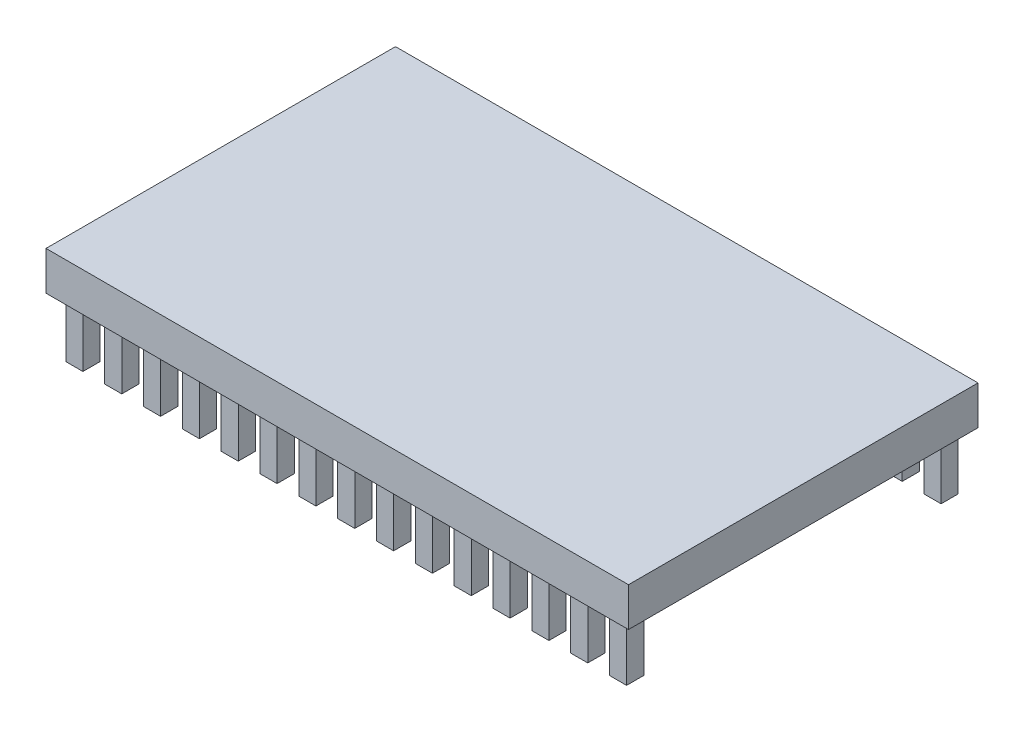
from build123d import *

# Parameters (mm, degrees)
SKETCH1_W           = 30
SKETCH1_H           = 18
BOSS_EXTRUDE1_DEPTH = 2
SKETCH2_W           = 0.883929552
SKETCH2_H           = 0.883929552
BOSS_EXTRUDE2_DEPTH = 3


with BuildPart() as part:
    # Sketch1 → Boss-Extrude1 (new body)
    with BuildSketch(Plane(origin=(0, 0, 0), x_dir=(1, 0, 0), z_dir=(0, 1, 0))):
        Rectangle(SKETCH1_W, SKETCH1_H)
    extrude(amount=BOSS_EXTRUDE1_DEPTH)

    # Sketch2 → Boss-Extrude2 (add)
    with BuildSketch(Plane.XZ):
        with Locations((-14, 8.098354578)):
            Rectangle(SKETCH2_W, SKETCH2_H)
        with Locations((-12, 8.098354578)):
            Rectangle(SKETCH2_W, SKETCH2_H)
        with Locations((-10, 8.098354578)):
            Rectangle(SKETCH2_W, SKETCH2_H)
        with Locations((-8, 8.098354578)):
            Rectangle(SKETCH2_W, SKETCH2_H)
        with Locations((-6, 8.098354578)):
            Rectangle(SKETCH2_W, SKETCH2_H)
        with Locations((-4, 8.098354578)):
            Rectangle(SKETCH2_W, SKETCH2_H)
        with Locations((-2, 8.098354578)):
            Rectangle(SKETCH2_W, SKETCH2_H)
        with Locations((0, 8.098354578)):
            Rectangle(SKETCH2_W, SKETCH2_H)
        with Locations((2, 8.098354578)):
            Rectangle(SKETCH2_W, SKETCH2_H)
        with Locations((4, 8.098354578)):
            Rectangle(SKETCH2_W, SKETCH2_H)
        with Locations((6, 8.098354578)):
            Rectangle(SKETCH2_W, SKETCH2_H)
        with Locations((8, 8.098354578)):
            Rectangle(SKETCH2_W, SKETCH2_H)
        with Locations((10, 8.098354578)):
            Rectangle(SKETCH2_W, SKETCH2_H)
        with Locations((12, 8.098354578)):
            Rectangle(SKETCH2_W, SKETCH2_H)
        with Locations((14, 8.098354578)):
            Rectangle(SKETCH2_W, SKETCH2_H)
        with Locations((-2, -8.098354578)):
            Rectangle(SKETCH2_W, SKETCH2_H)
        with Locations((-4, -8.098354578)):
            Rectangle(SKETCH2_W, SKETCH2_H)
        with Locations((-6, -8.098354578)):
            Rectangle(SKETCH2_W, SKETCH2_H)
        with Locations((14, -8.098354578)):
            Rectangle(SKETCH2_W, SKETCH2_H)
        with Locations((12, -8.098354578)):
            Rectangle(SKETCH2_W, SKETCH2_H)
        with Locations((10, -8.098354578)):
            Rectangle(SKETCH2_W, SKETCH2_H)
        with Locations((8, -8.098354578)):
            Rectangle(SKETCH2_W, SKETCH2_H)
        with Locations((6, -8.098354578)):
            Rectangle(SKETCH2_W, SKETCH2_H)
        with Locations((4, -8.098354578)):
            Rectangle(SKETCH2_W, SKETCH2_H)
        with Locations((2, -8.098354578)):
            Rectangle(SKETCH2_W, SKETCH2_H)
        with Locations((0, -8.098354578)):
            Rectangle(SKETCH2_W, SKETCH2_H)
        with Locations((-8, -8.098354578)):
            Rectangle(SKETCH2_W, SKETCH2_H)
        with Locations((-10, -8.098354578)):
            Rectangle(SKETCH2_W, SKETCH2_H)
        with Locations((-12, -8.098354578)):
            Rectangle(SKETCH2_W, SKETCH2_H)
        with Locations((-14, -8.098354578)):
            Rectangle(SKETCH2_W, SKETCH2_H)
    extrude(amount=BOSS_EXTRUDE2_DEPTH)


solid = part.part
